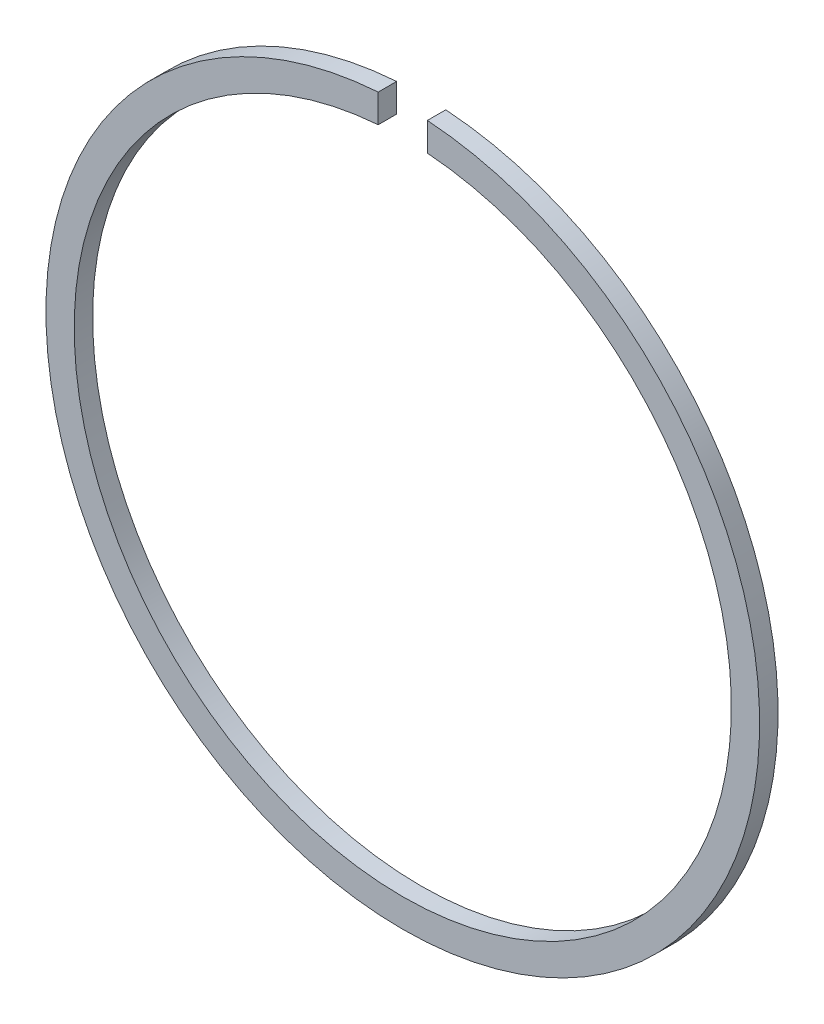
from build123d import *

# Parameters (mm, degrees)
ESQUISSE1_R             = 29.05
ESQUISSE1_R_2           = 26.75
EXTRUSION1_DEPTH        = 0.75
ENL_V_MAT_EXTRU_1_DEPTH = 42.11027852


with BuildPart() as part:
    # Esquisse1 → Extrusion1 (new, symmetric)
    with BuildSketch(Plane.XY):
        Circle(ESQUISSE1_R)
        Circle(ESQUISSE1_R_2, mode=Mode.SUBTRACT)
    extrude(amount=EXTRUSION1_DEPTH, both=True)

    # Esquisse3 → Enl_v. mat.-Extru.1 (cut, through all)
    with BuildSketch(Plane.XY.offset(0.75)):
        with BuildLine():
            Line((-2, 26.675128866), (-2, 28.981071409))
            ThreePointArc((-2, 28.981071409), (0, 29.05), (2, 28.981071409))
            Line((2, 28.981071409), (2, 26.675128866))
            ThreePointArc((2, 26.675128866), (0, 26.75), (-2, 26.675128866))
        make_face()
    extrude(amount=-ENL_V_MAT_EXTRU_1_DEPTH, mode=Mode.SUBTRACT)


solid = part.part
